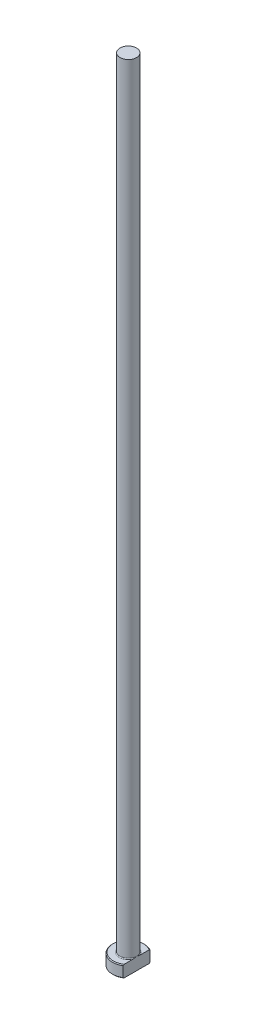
from build123d import *
from build123d.topology import SkipClean

# Parameters (mm, degrees)
CHAMFER1_SIZE = 0.2
FILLET1_R     = 0.2
KEY_DEPTH     = 201.079984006


with BuildPart() as part:
    # Sketch1 → Revolve1 (revolve)
    with BuildSketch(Plane.XY, mode=Mode.PRIVATE) as revolve1_sk:
        Polygon((0, 0), (-4, 0), (-4, 3), (-2.1, 3), (-2.1, 200), (0, 200), align=None)
    revolve(revolve1_sk.sketch.rotate(Axis((0, 259.958771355, 0), (0, -1, 0)), 270), axis=Axis((0, 259.958771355, 0), (0, -1, 0)))

    # Chamfer1
    chamfer1_edges = [part.edges().sort_by_distance(p)[0] for p in [
        (0, 3, -4),
        (0, 0, -4),
    ]]
    chamfer(chamfer1_edges, length=CHAMFER1_SIZE)

    # Fillet1
    fillet1_edges = [part.edges().sort_by_distance(p)[0] for p in [
        (0, 3, -2.1),
    ]]
    fillet(fillet1_edges, radius=FILLET1_R)

    # Sketch2 → KEY (cut, through all)
    with SkipClean():  # the faces are left unmerged after this step: merging them gives an invalid solid
        with BuildSketch(Plane(origin=(0, 0, 0), x_dir=(1, 0, 0), z_dir=(0, 1, 0))):
            with BuildLine():
                Line((2.1, 3.404408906), (2.1, -3.404408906))
                ThreePointArc((2.1, -3.404408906), (4, 0), (2.1, 3.404408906))
            make_face()
        extrude(amount=KEY_DEPTH, mode=Mode.SUBTRACT)


solid = part.part
